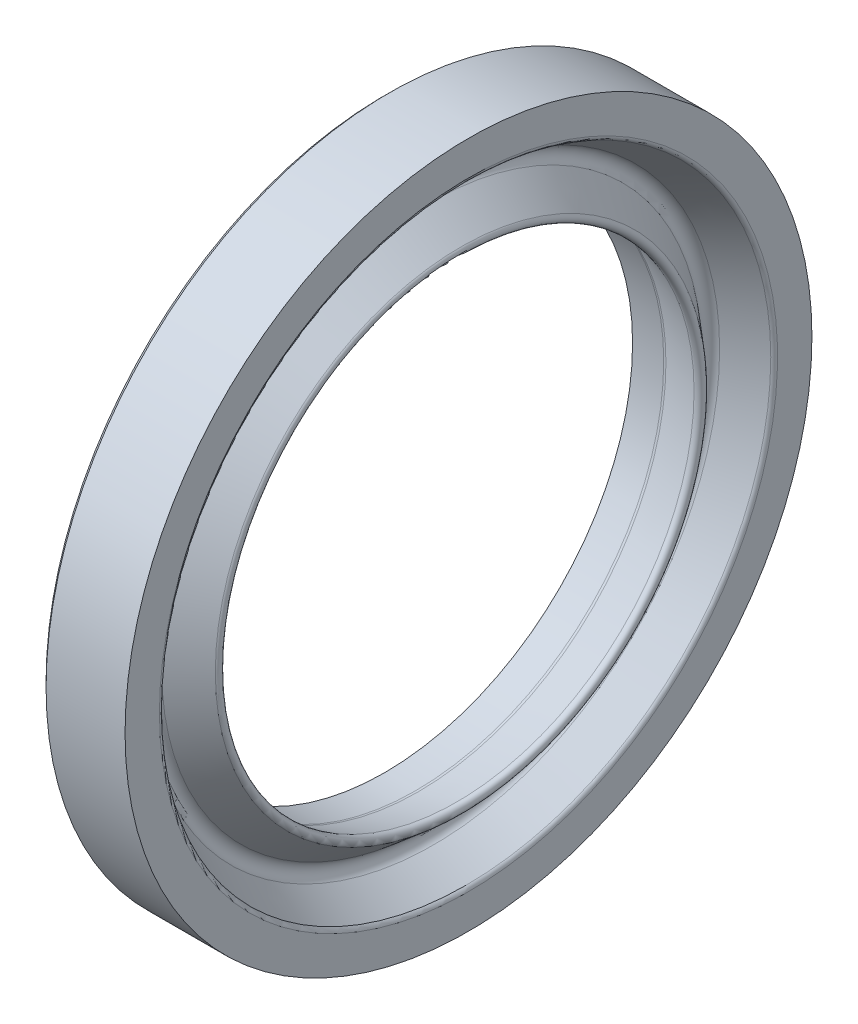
from build123d import *


with BuildPart() as part:
    # Esquisse1 → R_volution1 (revolve)
    with BuildSketch(Plane.XY, mode=Mode.PRIVATE) as r_volution1_sk:
        with BuildLine():
            Line((0.65, -45), (0, -44.35))
            Line((0, -44.35), (0, -32.5))
            Line((0, -32.5), (4.078851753, -32.5))
            ThreePointArc((4.078851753, -32.5), (4.248535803, -32.48887832), (4.415316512, -32.455703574))
            Line((4.415316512, -32.455703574), (9.45, -31.106664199))
            ThreePointArc((9.45, -31.106664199), (10.162672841, -31.420247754), (10.010773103, -32.183899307))
            Line((10.010773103, -32.183899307), (6.190270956, -35.389681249))
            ThreePointArc((6.190270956, -35.389681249), (5.731434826, -36.505427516), (6.387381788, -37.517926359))
            Line((6.387381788, -37.517926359), (10.671986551, -39.933863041))
            ThreePointArc((10.671986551, -39.933863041), (10.911988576, -40.17023029), (11, -40.495383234))
            Line((11, -40.495383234), (11, -45))
            Line((11, -45), (0.65, -45))
        make_face()
    revolve(r_volution1_sk.sketch.rotate(Axis((-33.896256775, 0, 0), (1, 0, 0)), 270), axis=Axis((-33.896256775, 0, 0), (1, 0, 0)))


solid = part.part
